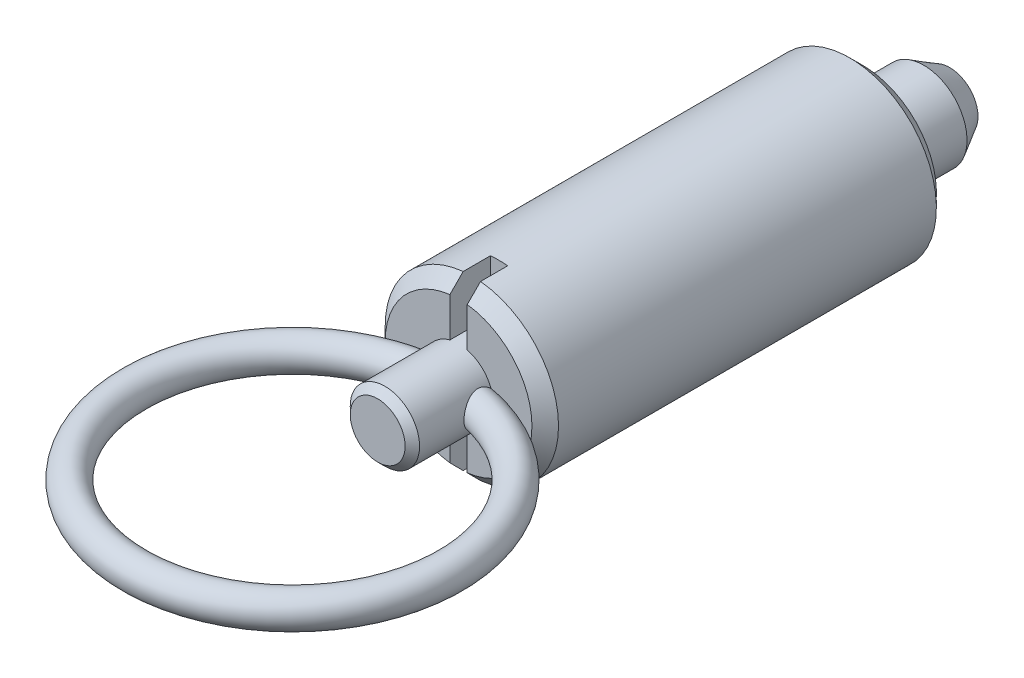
ISO-10303-21;
HEADER;
FILE_DESCRIPTION(('STEP AP214'),'2;1');
FILE_NAME('part.step','',(''),(''),'','','');
FILE_SCHEMA(('AUTOMOTIVE_DESIGN { 1 0 10303 214 1 1 1 1 }'));
ENDSEC;
DATA;
#1=APPLICATION_CONTEXT('core data for automotive mechanical design processes');
#2=APPLICATION_PROTOCOL_DEFINITION('international standard','automotive_design',2000,#1);
#3=PRODUCT_CONTEXT('',#1,'mechanical');
#4=PRODUCT('Part','Part','',(#3));
#5=PRODUCT_RELATED_PRODUCT_CATEGORY('part','',(#4));
#6=PRODUCT_DEFINITION_FORMATION('','',#4);
#7=PRODUCT_DEFINITION_CONTEXT('part definition',#1,'design');
#8=PRODUCT_DEFINITION('design','',#6,#7);
#9=PRODUCT_DEFINITION_SHAPE('','',#8);
#10=(LENGTH_UNIT() NAMED_UNIT(*) SI_UNIT(.MILLI.,.METRE.));
#11=(NAMED_UNIT(*) PLANE_ANGLE_UNIT() SI_UNIT($,.RADIAN.));
#12=(NAMED_UNIT(*) SI_UNIT($,.STERADIAN.) SOLID_ANGLE_UNIT());
#13=UNCERTAINTY_MEASURE_WITH_UNIT(LENGTH_MEASURE(1.E-05),#10,'distance_accuracy_value','');
#14=(GEOMETRIC_REPRESENTATION_CONTEXT(3) GLOBAL_UNCERTAINTY_ASSIGNED_CONTEXT((#13)) GLOBAL_UNIT_ASSIGNED_CONTEXT((#10,
#11,#12)) REPRESENTATION_CONTEXT('',''));
#15=CARTESIAN_POINT('',(0.,0.,0.));
#16=DIRECTION('',(0.,0.,1.));
#17=DIRECTION('',(1.,0.,0.));
#18=AXIS2_PLACEMENT_3D('',#15,#16,#17);
#19=CARTESIAN_POINT('',(1.96076951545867,0.,-6.));
#20=DIRECTION('',(0.,0.,1.));
#21=DIRECTION('',(0.,-1.,0.));
#22=AXIS2_PLACEMENT_3D('',#19,#20,#21);
#23=PLANE('',#22);
#24=CARTESIAN_POINT('',(0.,0.,-6.00000000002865));
#25=DIRECTION('',(0.,0.,1.));
#26=DIRECTION('',(0.,-1.,0.));
#27=AXIS2_PLACEMENT_3D('',#24,#25,#26);
#28=CIRCLE('',#27,1.9607695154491);
#29=CARTESIAN_POINT('',(0.,-1.9607695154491,-6.00000000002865));
#30=VERTEX_POINT('',#29);
#31=EDGE_CURVE('E17',#30,#30,#28,.T.);
#32=ORIENTED_EDGE('',*,*,#31,.F.);
#33=EDGE_LOOP('',(#32));
#34=FACE_BOUND('',#33,.T.);
#35=ADVANCED_FACE('F14',(#34),#23,.F.);
#36=CARTESIAN_POINT('',(0.,0.,-4.20000000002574));
#37=DIRECTION('',(0.,0.,1.));
#38=DIRECTION('',(0.,-1.,0.));
#39=AXIS2_PLACEMENT_3D('',#36,#37,#38);
#40=CONICAL_SURFACE('',#39,2.99999999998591,0.523598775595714);
#41=CARTESIAN_POINT('',(0.,0.,-4.2));
#42=DIRECTION('',(0.,0.,1.));
#43=DIRECTION('',(0.,-1.,0.));
#44=AXIS2_PLACEMENT_3D('',#41,#42,#43);
#45=CIRCLE('',#44,3.);
#46=CARTESIAN_POINT('',(0.,-3.,-4.2));
#47=VERTEX_POINT('',#46);
#48=EDGE_CURVE('E172',#47,#47,#45,.T.);
#49=ORIENTED_EDGE('',*,*,#48,.F.);
#50=EDGE_LOOP('',(#49));
#51=FACE_BOUND('',#50,.T.);
#52=ORIENTED_EDGE('',*,*,#31,.T.);
#53=EDGE_LOOP('',(#52));
#54=FACE_BOUND('',#53,.T.);
#55=ADVANCED_FACE('F307',(#51,#54),#40,.T.);
#56=CARTESIAN_POINT('',(0.,0.,-6.));
#57=DIRECTION('',(0.,0.,1.));
#58=DIRECTION('',(0.,-1.,0.));
#59=AXIS2_PLACEMENT_3D('',#56,#57,#58);
#60=CYLINDRICAL_SURFACE('',#59,3.);
#61=CARTESIAN_POINT('',(0.,0.,0.));
#62=DIRECTION('',(0.,0.,1.));
#63=DIRECTION('',(0.,-1.,0.));
#64=AXIS2_PLACEMENT_3D('',#61,#62,#63);
#65=CIRCLE('',#64,3.);
#66=CARTESIAN_POINT('',(0.,-3.,0.));
#67=VERTEX_POINT('',#66);
#68=EDGE_CURVE('E175',#67,#67,#65,.F.);
#69=ORIENTED_EDGE('',*,*,#68,.T.);
#70=EDGE_LOOP('',(#69));
#71=FACE_BOUND('',#70,.T.);
#72=ORIENTED_EDGE('',*,*,#48,.T.);
#73=EDGE_LOOP('',(#72));
#74=FACE_BOUND('',#73,.T.);
#75=ADVANCED_FACE('F304',(#71,#74),#60,.T.);
#76=CARTESIAN_POINT('',(5.08,0.,0.));
#77=DIRECTION('',(0.,0.,1.));
#78=DIRECTION('',(0.,-1.,0.));
#79=AXIS2_PLACEMENT_3D('',#76,#77,#78);
#80=PLANE('',#79);
#81=CARTESIAN_POINT('',(0.,0.,0.));
#82=DIRECTION('',(0.,0.,1.));
#83=DIRECTION('',(0.,-1.,0.));
#84=AXIS2_PLACEMENT_3D('',#81,#82,#83);
#85=CIRCLE('',#84,5.07999999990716);
#86=CARTESIAN_POINT('',(0.,-5.07999999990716,0.));
#87=VERTEX_POINT('',#86);
#88=EDGE_CURVE('E169',#87,#87,#85,.T.);
#89=ORIENTED_EDGE('',*,*,#88,.F.);
#90=EDGE_LOOP('',(#89));
#91=FACE_BOUND('',#90,.T.);
#92=ORIENTED_EDGE('',*,*,#68,.F.);
#93=EDGE_LOOP('',(#92));
#94=FACE_BOUND('',#93,.T.);
#95=ADVANCED_FACE('F300',(#91,#94),#80,.F.);
#96=CARTESIAN_POINT('',(0.,0.,0.920000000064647));
#97=DIRECTION('',(0.,0.,1.));
#98=DIRECTION('',(0.,-1.,0.));
#99=AXIS2_PLACEMENT_3D('',#96,#97,#98);
#100=CONICAL_SURFACE('',#99,5.99999999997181,0.785398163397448);
#101=CARTESIAN_POINT('',(0.,0.,0.92));
#102=DIRECTION('',(0.,0.,1.));
#103=DIRECTION('',(0.,-1.,0.));
#104=AXIS2_PLACEMENT_3D('',#101,#102,#103);
#105=CIRCLE('',#104,6.);
#106=CARTESIAN_POINT('',(0.,-6.,0.92));
#107=VERTEX_POINT('',#106);
#108=EDGE_CURVE('E109',#107,#107,#105,.T.);
#109=ORIENTED_EDGE('',*,*,#108,.F.);
#110=EDGE_LOOP('',(#109));
#111=FACE_BOUND('',#110,.T.);
#112=ORIENTED_EDGE('',*,*,#88,.T.);
#113=EDGE_LOOP('',(#112));
#114=FACE_BOUND('',#113,.T.);
#115=ADVANCED_FACE('F296',(#111,#114),#100,.T.);
#116=CARTESIAN_POINT('',(0.,0.,33.6));
#117=DIRECTION('',(0.,0.,-1.));
#118=DIRECTION('',(0.,1.,0.));
#119=AXIS2_PLACEMENT_3D('',#116,#117,#118);
#120=PLANE('',#119);
#121=CARTESIAN_POINT('',(0.,0.,33.6000000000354));
#122=DIRECTION('',(0.,0.,-1.));
#123=DIRECTION('',(0.,1.,0.));
#124=AXIS2_PLACEMENT_3D('',#121,#122,#123);
#125=CIRCLE('',#124,1.89999999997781);
#126=CARTESIAN_POINT('',(0.,1.89999999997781,33.6000000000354));
#127=VERTEX_POINT('',#126);
#128=EDGE_CURVE('E150',#127,#127,#125,.T.);
#129=ORIENTED_EDGE('',*,*,#128,.F.);
#130=EDGE_LOOP('',(#129));
#131=FACE_BOUND('',#130,.T.);
#132=ADVANCED_FACE('F284',(#131),#120,.F.);
#133=CARTESIAN_POINT('',(0.,0.,33.0999999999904));
#134=DIRECTION('',(0.,0.,-1.));
#135=DIRECTION('',(0.,1.,0.));
#136=AXIS2_PLACEMENT_3D('',#133,#134,#135);
#137=CONICAL_SURFACE('',#136,2.40000000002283,0.785398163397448);
#138=ORIENTED_EDGE('',*,*,#128,.T.);
#139=EDGE_LOOP('',(#138));
#140=FACE_BOUND('',#139,.T.);
#141=CARTESIAN_POINT('',(0.,0.,33.1));
#142=DIRECTION('',(0.,0.,1.));
#143=DIRECTION('',(0.,-1.,0.));
#144=AXIS2_PLACEMENT_3D('',#141,#142,#143);
#145=CIRCLE('',#144,2.4);
#146=CARTESIAN_POINT('',(0.,-2.4,33.1));
#147=VERTEX_POINT('',#146);
#148=EDGE_CURVE('E139',#147,#147,#145,.F.);
#149=ORIENTED_EDGE('',*,*,#148,.F.);
#150=EDGE_LOOP('',(#149));
#151=FACE_BOUND('',#150,.T.);
#152=ADVANCED_FACE('F281',(#140,#151),#137,.T.);
#153=CARTESIAN_POINT('',(0.,0.,39.5));
#154=DIRECTION('',(0.,-1.,0.));
#155=DIRECTION('',(1.,0.,0.));
#156=AXIS2_PLACEMENT_3D('',#153,#154,#155);
#157=TOROIDAL_SURFACE('',#156,10.925,1.15);
#158=CARTESIAN_POINT('',(2.25093297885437,0.83264681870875,28.0000000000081));
#159=CARTESIAN_POINT('',(2.24318235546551,0.853601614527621,28.0208983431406));
#160=CARTESIAN_POINT('',(2.2354182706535,0.873688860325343,28.042644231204));
#161=CARTESIAN_POINT('',(2.22005226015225,0.912027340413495,28.0877651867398));
#162=CARTESIAN_POINT('',(2.21245039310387,0.930277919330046,28.1111408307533));
#163=CARTESIAN_POINT('',(2.19015787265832,0.98215394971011,28.1836632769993));
#164=CARTESIAN_POINT('',(2.17600491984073,1.01283961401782,28.2351419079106));
#165=CARTESIAN_POINT('',(2.15073695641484,1.06545410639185,28.3432740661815));
#166=CARTESIAN_POINT('',(2.13963088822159,1.08735724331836,28.3999421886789));
#167=CARTESIAN_POINT('',(2.12189902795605,1.12157072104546,28.5166728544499));
#168=CARTESIAN_POINT('',(2.11526441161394,1.1338999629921,28.5767284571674));
#169=CARTESIAN_POINT('',(2.10741928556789,1.14841085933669,28.6950653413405));
#170=CARTESIAN_POINT('',(2.10593493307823,1.15110506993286,28.753267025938));
#171=CARTESIAN_POINT('',(2.10758709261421,1.14807568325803,28.8694070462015));
#172=CARTESIAN_POINT('',(2.11072755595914,1.14234488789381,28.9273451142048));
#173=CARTESIAN_POINT('',(2.12116456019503,1.12284583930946,29.0428668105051));
#174=CARTESIAN_POINT('',(2.12855851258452,1.10888900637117,29.1004089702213));
#175=CARTESIAN_POINT('',(2.14659803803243,1.0735491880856,29.212646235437));
#176=CARTESIAN_POINT('',(2.15724665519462,1.05215924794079,29.2673386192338));
#177=CARTESIAN_POINT('',(2.18257426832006,0.998687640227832,29.3814452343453));
#178=CARTESIAN_POINT('',(2.19762448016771,0.965449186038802,29.4402354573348));
#179=CARTESIAN_POINT('',(2.22900957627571,0.890597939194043,29.5519406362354));
#180=CARTESIAN_POINT('',(2.24534628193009,0.848973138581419,29.6048469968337));
#181=CARTESIAN_POINT('',(2.27964870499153,0.7524181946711,29.7094616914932));
#182=CARTESIAN_POINT('',(2.29757633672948,0.696493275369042,29.7602746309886));
#183=CARTESIAN_POINT('',(2.33079916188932,0.575568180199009,29.8507043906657));
#184=CARTESIAN_POINT('',(2.34609991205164,0.510587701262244,29.8903449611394));
#185=CARTESIAN_POINT('',(2.3681712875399,0.392763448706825,29.9462821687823));
#186=CARTESIAN_POINT('',(2.37612995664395,0.341767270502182,29.9660128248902));
#187=CARTESIAN_POINT('',(2.38885584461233,0.236947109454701,29.9972814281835));
#188=CARTESIAN_POINT('',(2.39362629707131,0.183126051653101,30.0088276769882));
#189=CARTESIAN_POINT('',(2.39948759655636,0.0738938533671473,30.0229875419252));
#190=CARTESIAN_POINT('',(2.40056413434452,0.0184773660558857,30.025566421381));
#191=CARTESIAN_POINT('',(2.39887335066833,-0.0919608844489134,30.0214968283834));
#192=CARTESIAN_POINT('',(2.39610549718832,-0.14698259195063,30.0148470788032));
#193=CARTESIAN_POINT('',(2.38730168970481,-0.251796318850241,29.9934528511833));
#194=CARTESIAN_POINT('',(2.38146308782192,-0.301707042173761,29.9791965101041));
#195=CARTESIAN_POINT('',(2.36716729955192,-0.398656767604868,29.9437052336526));
#196=CARTESIAN_POINT('',(2.35870524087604,-0.44569022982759,29.9224573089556));
#197=CARTESIAN_POINT('',(2.33890326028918,-0.540461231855,29.8715607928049));
#198=CARTESIAN_POINT('',(2.32736380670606,-0.587824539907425,29.8412972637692));
#199=CARTESIAN_POINT('',(2.30284819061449,-0.677535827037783,29.7746764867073));
#200=CARTESIAN_POINT('',(2.28987279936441,-0.719886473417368,29.738322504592));
#201=CARTESIAN_POINT('',(2.26081945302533,-0.806961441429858,29.6529300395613));
#202=CARTESIAN_POINT('',(2.24462482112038,-0.850575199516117,29.6027967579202));
#203=CARTESIAN_POINT('',(2.21295120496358,-0.929878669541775,29.4963344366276));
#204=CARTESIAN_POINT('',(2.19747318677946,-0.965557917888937,29.4399973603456));
#205=CARTESIAN_POINT('',(2.16693809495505,-1.03242467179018,29.3144430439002));
#206=CARTESIAN_POINT('',(2.15219910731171,-1.0624197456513,29.2445041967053));
#207=CARTESIAN_POINT('',(2.12805515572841,-1.11000364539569,29.0996724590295));
#208=CARTESIAN_POINT('',(2.11864109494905,-1.12761364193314,29.024788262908));
#209=CARTESIAN_POINT('',(2.10855731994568,-1.1463268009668,28.890472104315));
#210=CARTESIAN_POINT('',(2.10634937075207,-1.15034266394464,28.8315590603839));
#211=CARTESIAN_POINT('',(2.10674998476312,-1.14961251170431,28.7138369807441));
#212=CARTESIAN_POINT('',(2.10935257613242,-1.14487736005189,28.655027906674));
#213=CARTESIAN_POINT('',(2.11924768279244,-1.12645261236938,28.5391729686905));
#214=CARTESIAN_POINT('',(2.12654507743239,-1.11275369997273,28.4821290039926));
#215=CARTESIAN_POINT('',(2.14504593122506,-1.07665495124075,28.3714399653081));
#216=CARTESIAN_POINT('',(2.15625598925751,-1.0542404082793,28.3178008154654));
#217=CARTESIAN_POINT('',(2.18089440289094,-1.00224393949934,28.2170485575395));
#218=CARTESIAN_POINT('',(2.19423748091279,-0.97292255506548,28.1697786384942));
#219=CARTESIAN_POINT('',(2.22205387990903,-0.907601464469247,28.0806701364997));
#220=CARTESIAN_POINT('',(2.23652414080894,-0.871619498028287,28.0388176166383));
#221=CARTESIAN_POINT('',(2.2509329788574,-0.832646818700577,28.));
#222=B_SPLINE_CURVE_WITH_KNOTS('',3,(#158,#159,#160,#161,#162,#163,#164,#165,#166,#167,#168,
#169,#170,#171,#172,#173,#174,#175,#176,#177,#178,#179,#180,#181,#182,#183,#184,#185,#186,#187,
#188,#189,#190,#191,#192,#193,#194,#195,#196,#197,#198,#199,#200,#201,#202,#203,#204,#205,#206,
#207,#208,#209,#210,#211,#212,#213,#214,#215,#216,#217,#218,#219,#220,#221),.UNSPECIFIED.,.F.,
.F.,(4,2,2,2,2,2,2,2,2,2,2,2,2,2,2,2,2,2,2,2,2,2,2,2,2,2,2,2,2,2,2,4),(0.,0.0917288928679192,
0.183490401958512,0.367291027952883,0.551625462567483,0.735595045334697,0.909619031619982,
1.08379178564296,1.2621218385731,1.4406191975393,1.64738609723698,1.85445118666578,
2.08621136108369,2.3174750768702,2.48256458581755,2.64748640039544,2.81304636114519,
2.97862923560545,3.13467793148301,3.29101819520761,3.46252326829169,3.63393666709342,
3.83832424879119,4.04297978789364,4.27432259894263,4.50526899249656,4.68177135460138,
4.8580547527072,5.03452166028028,5.21128763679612,5.38222834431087,5.55272015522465),.UNSPECIFIED.);
#223=CARTESIAN_POINT('',(2.25093297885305,0.832646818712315,28.0000000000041));
#224=VERTEX_POINT('',#223);
#225=CARTESIAN_POINT('',(2.2509329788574,-0.832646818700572,28.));
#226=VERTEX_POINT('',#225);
#227=EDGE_CURVE('E23',#224,#226,#222,.T.);
#228=ORIENTED_EDGE('',*,*,#227,.T.);
#229=CARTESIAN_POINT('',(2.25093297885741,-0.832646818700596,28.));
#230=CARTESIAN_POINT('',(2.31244020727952,-0.821371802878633,28.));
#231=CARTESIAN_POINT('',(2.37380615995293,-0.809235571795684,28.));
#232=CARTESIAN_POINT('',(2.49699923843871,-0.782641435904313,28.));
#233=CARTESIAN_POINT('',(2.55881936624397,-0.768151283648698,28.));
#234=CARTESIAN_POINT('',(2.68218413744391,-0.736466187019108,28.));
#235=CARTESIAN_POINT('',(2.74372462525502,-0.719254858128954,28.));
#236=CARTESIAN_POINT('',(2.86866507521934,-0.680707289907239,28.));
#237=CARTESIAN_POINT('',(2.9320182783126,-0.659216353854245,28.));
#238=CARTESIAN_POINT('',(3.05672223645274,-0.611821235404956,28.));
#239=CARTESIAN_POINT('',(3.11808114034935,-0.585938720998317,28.));
#240=CARTESIAN_POINT('',(3.23781949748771,-0.528355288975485,28.));
#241=CARTESIAN_POINT('',(3.29621083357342,-0.496680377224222,28.));
#242=CARTESIAN_POINT('',(3.36715476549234,-0.45129379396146,28.));
#243=CARTESIAN_POINT('',(3.38210279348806,-0.44131269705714,28.));
#244=CARTESIAN_POINT('',(3.41153925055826,-0.420686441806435,28.));
#245=CARTESIAN_POINT('',(3.42602753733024,-0.410041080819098,28.));
#246=CARTESIAN_POINT('',(3.46865936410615,-0.377017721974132,28.));
#247=CARTESIAN_POINT('',(3.49598141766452,-0.353545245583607,28.));
#248=CARTESIAN_POINT('',(3.54769301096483,-0.302728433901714,28.));
#249=CARTESIAN_POINT('',(3.57202881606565,-0.275328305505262,28.));
#250=CARTESIAN_POINT('',(3.61517498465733,-0.216482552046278,28.));
#251=CARTESIAN_POINT('',(3.6340137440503,-0.185058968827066,28.));
#252=CARTESIAN_POINT('',(3.65709077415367,-0.132649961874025,28.));
#253=CARTESIAN_POINT('',(3.66413159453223,-0.112903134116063,28.));
#254=CARTESIAN_POINT('',(3.67487276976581,-0.0725134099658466,28.));
#255=CARTESIAN_POINT('',(3.6785760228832,-0.0518713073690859,28.));
#256=CARTESIAN_POINT('',(3.68227223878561,-0.0101626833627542,28.));
#257=CARTESIAN_POINT('',(3.68224965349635,0.0109052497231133,28.));
#258=CARTESIAN_POINT('',(3.67845747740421,0.0527030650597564,28.));
#259=CARTESIAN_POINT('',(3.67468601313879,0.0734327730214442,28.));
#260=CARTESIAN_POINT('',(3.66403458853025,0.113049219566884,28.));
#261=CARTESIAN_POINT('',(3.65730296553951,0.131976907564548,28.));
#262=CARTESIAN_POINT('',(3.64128176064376,0.168729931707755,28.));
#263=CARTESIAN_POINT('',(3.63198799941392,0.186553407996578,28.));
#264=CARTESIAN_POINT('',(3.60387247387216,0.233468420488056,28.));
#265=CARTESIAN_POINT('',(3.58303209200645,0.261345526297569,28.));
#266=CARTESIAN_POINT('',(3.53738719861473,0.313645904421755,28.));
#267=CARTESIAN_POINT('',(3.51256957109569,0.338057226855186,28.));
#268=CARTESIAN_POINT('',(3.46179038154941,0.382616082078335,28.));
#269=CARTESIAN_POINT('',(3.4359677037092,0.402924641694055,28.));
#270=CARTESIAN_POINT('',(3.38269480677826,0.441299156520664,28.));
#271=CARTESIAN_POINT('',(3.35524320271,0.45936316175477,28.));
#272=CARTESIAN_POINT('',(3.29900962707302,0.49369332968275,28.));
#273=CARTESIAN_POINT('',(3.27022031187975,0.509947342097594,28.));
#274=CARTESIAN_POINT('',(3.21179454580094,0.540805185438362,28.));
#275=CARTESIAN_POINT('',(3.1821584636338,0.555409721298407,28.));
#276=CARTESIAN_POINT('',(3.103804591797,0.591766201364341,28.));
#277=CARTESIAN_POINT('',(3.05456330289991,0.612388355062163,28.));
#278=CARTESIAN_POINT('',(2.95491310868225,0.650720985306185,28.));
#279=CARTESIAN_POINT('',(2.90450284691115,0.668427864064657,28.));
#280=CARTESIAN_POINT('',(2.8028329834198,0.701453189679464,28.));
#281=CARTESIAN_POINT('',(2.7515722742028,0.716768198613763,28.));
#282=CARTESIAN_POINT('',(2.65058410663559,0.744795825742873,28.));
#283=CARTESIAN_POINT('',(2.60087870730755,0.757588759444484,28.));
#284=CARTESIAN_POINT('',(2.50117986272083,0.781563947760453,28.));
#285=CARTESIAN_POINT('',(2.45118710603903,0.792749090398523,28.));
#286=CARTESIAN_POINT('',(2.35113965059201,0.813694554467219,28.));
#287=CARTESIAN_POINT('',(2.30108626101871,0.823461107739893,28.));
#288=CARTESIAN_POINT('',(2.2509329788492,0.832646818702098,28.));
#289=B_SPLINE_CURVE_WITH_KNOTS('',3,(#229,#230,#231,#232,#233,#234,#235,#236,#237,#238,#239,
#240,#241,#242,#243,#244,#245,#246,#247,#248,#249,#250,#251,#252,#253,#254,#255,#256,#257,#258,
#259,#260,#261,#262,#263,#264,#265,#266,#267,#268,#269,#270,#271,#272,#273,#274,#275,#276,#277,
#278,#279,#280,#281,#282,#283,#284,#285,#286,#287,#288),.UNSPECIFIED.,.F.,.F.,(4,2,2,2,2,2,2,2,
2,2,2,2,2,2,2,2,2,2,2,2,2,2,2,2,2,2,2,2,2,4),(0.,0.187615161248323,0.378059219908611,
0.569696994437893,0.770253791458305,0.969848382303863,1.16856793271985,1.22247425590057,
1.27639710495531,1.38420213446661,1.49372694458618,1.60267554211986,1.66532815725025,
1.72792631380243,1.79078570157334,1.85367651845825,1.91372233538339,1.97386668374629,
2.07767877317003,2.18184053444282,2.28024938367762,2.3787431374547,2.47786259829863,
2.5769395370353,2.73696386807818,2.89718423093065,3.05763280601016,3.21157860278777,
3.36524432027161,3.51821312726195),.UNSPECIFIED.);
#290=EDGE_CURVE('E9',#226,#224,#289,.T.);
#291=ORIENTED_EDGE('',*,*,#290,.T.);
#292=EDGE_LOOP('',(#228,#291));
#293=FACE_BOUND('',#292,.T.);
#294=CARTESIAN_POINT('',(-2.2509329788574,0.832646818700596,28.));
#295=CARTESIAN_POINT('',(-2.31244020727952,0.821371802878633,28.));
#296=CARTESIAN_POINT('',(-2.37380615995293,0.809235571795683,28.));
#297=CARTESIAN_POINT('',(-2.49699923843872,0.782641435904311,28.));
#298=CARTESIAN_POINT('',(-2.55881936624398,0.768151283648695,28.));
#299=CARTESIAN_POINT('',(-2.68218413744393,0.736466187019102,28.));
#300=CARTESIAN_POINT('',(-2.74372462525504,0.719254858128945,28.));
#301=CARTESIAN_POINT('',(-2.86866507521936,0.68070728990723,28.));
#302=CARTESIAN_POINT('',(-2.93201827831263,0.659216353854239,28.));
#303=CARTESIAN_POINT('',(-3.05672223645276,0.611821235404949,28.));
#304=CARTESIAN_POINT('',(-3.11808114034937,0.585938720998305,28.));
#305=CARTESIAN_POINT('',(-3.23781949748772,0.528355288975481,28.));
#306=CARTESIAN_POINT('',(-3.29621083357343,0.49668037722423,28.));
#307=CARTESIAN_POINT('',(-3.36715476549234,0.451293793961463,28.));
#308=CARTESIAN_POINT('',(-3.38210279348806,0.441312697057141,28.));
#309=CARTESIAN_POINT('',(-3.41153925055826,0.420686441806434,28.));
#310=CARTESIAN_POINT('',(-3.42602753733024,0.410041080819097,28.));
#311=CARTESIAN_POINT('',(-3.46865936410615,0.377017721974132,28.));
#312=CARTESIAN_POINT('',(-3.49598141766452,0.353545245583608,28.));
#313=CARTESIAN_POINT('',(-3.54769301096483,0.302728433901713,28.));
#314=CARTESIAN_POINT('',(-3.57202881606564,0.275328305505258,28.));
#315=CARTESIAN_POINT('',(-3.61517498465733,0.216482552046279,28.));
#316=CARTESIAN_POINT('',(-3.63401374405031,0.185058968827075,28.));
#317=CARTESIAN_POINT('',(-3.65709077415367,0.132649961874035,28.));
#318=CARTESIAN_POINT('',(-3.66413159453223,0.112903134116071,28.));
#319=CARTESIAN_POINT('',(-3.67487276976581,0.0725134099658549,28.));
#320=CARTESIAN_POINT('',(-3.6785760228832,0.0518713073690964,28.));
#321=CARTESIAN_POINT('',(-3.68227223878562,0.0101626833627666,28.));
#322=CARTESIAN_POINT('',(-3.68224965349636,-0.0109052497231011,28.));
#323=CARTESIAN_POINT('',(-3.67845747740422,-0.0527030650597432,28.));
#324=CARTESIAN_POINT('',(-3.6746860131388,-0.0734327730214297,28.));
#325=CARTESIAN_POINT('',(-3.66403458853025,-0.113049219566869,28.));
#326=CARTESIAN_POINT('',(-3.65730296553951,-0.131976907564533,28.));
#327=CARTESIAN_POINT('',(-3.64128176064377,-0.168729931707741,28.));
#328=CARTESIAN_POINT('',(-3.63198799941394,-0.186553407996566,28.));
#329=CARTESIAN_POINT('',(-3.60387247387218,-0.233468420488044,28.));
#330=CARTESIAN_POINT('',(-3.58303209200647,-0.261345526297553,28.));
#331=CARTESIAN_POINT('',(-3.53738719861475,-0.313645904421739,28.));
#332=CARTESIAN_POINT('',(-3.51256957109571,-0.338057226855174,28.));
#333=CARTESIAN_POINT('',(-3.46179038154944,-0.382616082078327,28.));
#334=CARTESIAN_POINT('',(-3.43596770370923,-0.402924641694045,28.));
#335=CARTESIAN_POINT('',(-3.38269480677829,-0.441299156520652,28.));
#336=CARTESIAN_POINT('',(-3.35524320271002,-0.459363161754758,28.));
#337=CARTESIAN_POINT('',(-3.29900962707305,-0.493693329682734,28.));
#338=CARTESIAN_POINT('',(-3.27022031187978,-0.509947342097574,28.));
#339=CARTESIAN_POINT('',(-3.21179454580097,-0.540805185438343,28.));
#340=CARTESIAN_POINT('',(-3.18215846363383,-0.55540972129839,28.));
#341=CARTESIAN_POINT('',(-3.10380459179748,-0.591766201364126,28.));
#342=CARTESIAN_POINT('',(-3.05456330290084,-0.612388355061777,28.));
#343=CARTESIAN_POINT('',(-2.9549131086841,-0.650720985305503,28.));
#344=CARTESIAN_POINT('',(-2.90450284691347,-0.668427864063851,28.));
#345=CARTESIAN_POINT('',(-2.80283298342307,-0.701453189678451,28.));
#346=CARTESIAN_POINT('',(-2.75157227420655,-0.716768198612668,28.));
#347=CARTESIAN_POINT('',(-2.65058410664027,-0.74479582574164,28.));
#348=CARTESIAN_POINT('',(-2.60087870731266,-0.757588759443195,28.));
#349=CARTESIAN_POINT('',(-2.50117986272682,-0.781563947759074,28.));
#350=CARTESIAN_POINT('',(-2.45118710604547,-0.792749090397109,28.));
#351=CARTESIAN_POINT('',(-2.35113965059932,-0.813694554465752,28.));
#352=CARTESIAN_POINT('',(-2.30108626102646,-0.823461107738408,28.));
#353=CARTESIAN_POINT('',(-2.25093297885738,-0.832646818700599,28.));
#354=B_SPLINE_CURVE_WITH_KNOTS('',3,(#294,#295,#296,#297,#298,#299,#300,#301,#302,#303,#304,
#305,#306,#307,#308,#309,#310,#311,#312,#313,#314,#315,#316,#317,#318,#319,#320,#321,#322,#323,
#324,#325,#326,#327,#328,#329,#330,#331,#332,#333,#334,#335,#336,#337,#338,#339,#340,#341,#342,
#343,#344,#345,#346,#347,#348,#349,#350,#351,#352,#353),.UNSPECIFIED.,.F.,.F.,(4,2,2,2,2,2,2,2,
2,2,2,2,2,2,2,2,2,2,2,2,2,2,2,2,2,2,2,2,2,4),(0.,0.187615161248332,0.378059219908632,
0.569696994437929,0.770253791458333,0.969848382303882,1.16856793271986,1.22247425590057,
1.27639710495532,1.38420213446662,1.49372694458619,1.60267554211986,1.66532815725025,
1.72792631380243,1.79078570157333,1.85367651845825,1.91372233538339,1.97386668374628,
2.07767877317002,2.18184053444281,2.28024938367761,2.37874313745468,2.47786259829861,
2.57693953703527,2.73696386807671,2.89718423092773,3.05763280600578,3.21157860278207,
3.3652443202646,3.51821312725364),.UNSPECIFIED.);
#355=CARTESIAN_POINT('',(-2.2509329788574,0.832646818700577,28.));
#356=VERTEX_POINT('',#355);
#357=CARTESIAN_POINT('',(-2.25093297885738,-0.8326468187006,28.));
#358=VERTEX_POINT('',#357);
#359=EDGE_CURVE('E206',#356,#358,#354,.T.);
#360=ORIENTED_EDGE('',*,*,#359,.T.);
#361=CARTESIAN_POINT('',(-2.25093297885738,-0.8326468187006,28.));
#362=CARTESIAN_POINT('',(-2.24318235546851,-0.85360161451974,28.0208983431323));
#363=CARTESIAN_POINT('',(-2.23541827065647,-0.873688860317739,28.0426442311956));
#364=CARTESIAN_POINT('',(-2.22005226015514,-0.912027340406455,28.087765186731));
#365=CARTESIAN_POINT('',(-2.21245039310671,-0.930277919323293,28.1111408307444));
#366=CARTESIAN_POINT('',(-2.19015787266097,-0.98215394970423,28.18366327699));
#367=CARTESIAN_POINT('',(-2.17600491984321,-1.01283961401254,28.2351419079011));
#368=CARTESIAN_POINT('',(-2.15073695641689,-1.06545410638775,28.3432740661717));
#369=CARTESIAN_POINT('',(-2.13963088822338,-1.08735724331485,28.399942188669));
#370=CARTESIAN_POINT('',(-2.12189902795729,-1.12157072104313,28.5166728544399));
#371=CARTESIAN_POINT('',(-2.11526441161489,-1.13389996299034,28.5767284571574));
#372=CARTESIAN_POINT('',(-2.10741928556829,-1.14841085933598,28.6950653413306));
#373=CARTESIAN_POINT('',(-2.10593493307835,-1.15110506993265,28.7532670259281));
#374=CARTESIAN_POINT('',(-2.10758709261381,-1.14807568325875,28.8694070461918));
#375=CARTESIAN_POINT('',(-2.11072755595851,-1.14234488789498,28.9273451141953));
#376=CARTESIAN_POINT('',(-2.12116456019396,-1.1228458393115,29.0428668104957));
#377=CARTESIAN_POINT('',(-2.12855851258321,-1.10888900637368,29.1004089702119));
#378=CARTESIAN_POINT('',(-2.1465980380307,-1.07354918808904,29.2126462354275));
#379=CARTESIAN_POINT('',(-2.15724665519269,-1.05215924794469,29.2673386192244));
#380=CARTESIAN_POINT('',(-2.18257426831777,-0.998687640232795,29.381445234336));
#381=CARTESIAN_POINT('',(-2.19762448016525,-0.96544918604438,29.4402354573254));
#382=CARTESIAN_POINT('',(-2.22900957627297,-0.890597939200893,29.5519406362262));
#383=CARTESIAN_POINT('',(-2.24534628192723,-0.848973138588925,29.6048469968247));
#384=CARTESIAN_POINT('',(-2.27964870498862,-0.752418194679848,29.7094616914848));
#385=CARTESIAN_POINT('',(-2.29757633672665,-0.696493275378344,29.7602746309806));
#386=CARTESIAN_POINT('',(-2.33079916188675,-0.575568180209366,29.8507043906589));
#387=CARTESIAN_POINT('',(-2.34609991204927,-0.510587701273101,29.8903449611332));
#388=CARTESIAN_POINT('',(-2.368171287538,-0.392763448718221,29.9462821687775));
#389=CARTESIAN_POINT('',(-2.37612995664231,-0.341767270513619,29.9660128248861));
#390=CARTESIAN_POINT('',(-2.3888558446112,-0.236947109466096,29.9972814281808));
#391=CARTESIAN_POINT('',(-2.39362629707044,-0.183126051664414,30.0088276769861));
#392=CARTESIAN_POINT('',(-2.39948759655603,-0.0738938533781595,30.0229875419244));
#393=CARTESIAN_POINT('',(-2.40056413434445,-0.0184773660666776,30.0255664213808));
#394=CARTESIAN_POINT('',(-2.39887335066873,0.0919608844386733,30.0214968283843));
#395=CARTESIAN_POINT('',(-2.39610549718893,0.146982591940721,30.0148470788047));
#396=CARTESIAN_POINT('',(-2.3873016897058,0.251796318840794,29.9934528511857));
#397=CARTESIAN_POINT('',(-2.3814630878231,0.301707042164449,29.979196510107));
#398=CARTESIAN_POINT('',(-2.36716729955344,0.398656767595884,29.9437052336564));
#399=CARTESIAN_POINT('',(-2.35870524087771,0.445690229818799,29.9224573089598));
#400=CARTESIAN_POINT('',(-2.33890326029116,0.540461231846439,29.87156079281));
#401=CARTESIAN_POINT('',(-2.32736380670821,0.587824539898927,29.8412972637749));
#402=CARTESIAN_POINT('',(-2.30284819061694,0.677535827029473,29.7746764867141));
#403=CARTESIAN_POINT('',(-2.28987279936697,0.719886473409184,29.7383225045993));
#404=CARTESIAN_POINT('',(-2.26081945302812,0.806961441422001,29.6529300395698));
#405=CARTESIAN_POINT('',(-2.24462482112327,0.850575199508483,29.6027967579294));
#406=CARTESIAN_POINT('',(-2.21295120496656,0.929878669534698,29.4963344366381));
#407=CARTESIAN_POINT('',(-2.19747318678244,0.965557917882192,29.4399973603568));
#408=CARTESIAN_POINT('',(-2.1669380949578,1.03242467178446,29.3144430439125));
#409=CARTESIAN_POINT('',(-2.15219910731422,1.06241974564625,29.2445041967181));
#410=CARTESIAN_POINT('',(-2.12805515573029,1.11000364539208,29.099672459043));
#411=CARTESIAN_POINT('',(-2.11864109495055,1.12761364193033,29.0247882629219));
#412=CARTESIAN_POINT('',(-2.10855731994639,1.14632680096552,28.890472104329));
#413=CARTESIAN_POINT('',(-2.1063493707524,1.15034266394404,28.8315590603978));
#414=CARTESIAN_POINT('',(-2.1067499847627,1.14961251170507,28.7138369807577));
#415=CARTESIAN_POINT('',(-2.10935257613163,1.14487736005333,28.6550279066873));
#416=CARTESIAN_POINT('',(-2.11924768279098,1.1264526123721,28.5391729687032));
#417=CARTESIAN_POINT('',(-2.12654507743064,1.11275369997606,28.482129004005));
#418=CARTESIAN_POINT('',(-2.14504593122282,1.07665495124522,28.3714399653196));
#419=CARTESIAN_POINT('',(-2.15625598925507,1.05424040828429,28.3178008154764));
#420=CARTESIAN_POINT('',(-2.18089440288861,1.00224393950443,28.217048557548));
#421=CARTESIAN_POINT('',(-2.19423748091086,0.972922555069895,28.1697786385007));
#422=CARTESIAN_POINT('',(-2.22205387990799,0.90760146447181,28.0806701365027));
#423=CARTESIAN_POINT('',(-2.23652414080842,0.871619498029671,28.0388176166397));
#424=CARTESIAN_POINT('',(-2.25093297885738,0.832646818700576,28.));
#425=B_SPLINE_CURVE_WITH_KNOTS('',3,(#361,#362,#363,#364,#365,#366,#367,#368,#369,#370,#371,
#372,#373,#374,#375,#376,#377,#378,#379,#380,#381,#382,#383,#384,#385,#386,#387,#388,#389,#390,
#391,#392,#393,#394,#395,#396,#397,#398,#399,#400,#401,#402,#403,#404,#405,#406,#407,#408,#409,
#410,#411,#412,#413,#414,#415,#416,#417,#418,#419,#420,#421,#422,#423,#424),.UNSPECIFIED.,.F.,
.F.,(4,2,2,2,2,2,2,2,2,2,2,2,2,2,2,2,2,2,2,2,2,2,2,2,2,2,2,2,2,2,2,4),(0.,0.0917288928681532,
0.183490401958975,0.36729102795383,0.551625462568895,0.735595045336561,0.90961903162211,
1.08379178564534,1.26212183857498,1.44061919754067,1.64738609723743,1.85445118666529,
2.08621136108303,2.31747507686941,2.48256458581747,2.64748640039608,2.81304636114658,
2.97862923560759,3.13467793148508,3.29101819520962,3.46252326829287,3.63393666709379,
3.83832424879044,4.04297978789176,4.2743225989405,4.5052689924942,4.68177135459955,
4.85805475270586,5.03452166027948,5.21128763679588,5.38222834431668,5.55272015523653),.UNSPECIFIED.);
#426=EDGE_CURVE('E213',#358,#356,#425,.T.);
#427=ORIENTED_EDGE('',*,*,#426,.T.);
#428=EDGE_LOOP('',(#360,#427));
#429=FACE_BOUND('',#428,.T.);
#430=ADVANCED_FACE('F190',(#293,#429),#157,.T.);
#431=CARTESIAN_POINT('',(0.,0.,28.));
#432=DIRECTION('',(0.,0.,-1.));
#433=DIRECTION('',(0.,1.,0.));
#434=AXIS2_PLACEMENT_3D('',#431,#432,#433);
#435=PLANE('',#434);
#436=ORIENTED_EDGE('',*,*,#290,.F.);
#437=CARTESIAN_POINT('',(0.,0.,28.));
#438=DIRECTION('',(0.,0.,1.));
#439=DIRECTION('',(0.,-1.,0.));
#440=AXIS2_PLACEMENT_3D('',#437,#438,#439);
#441=CIRCLE('',#440,2.4);
#442=CARTESIAN_POINT('',(0.6,-2.32379000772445,28.));
#443=VERTEX_POINT('',#442);
#444=EDGE_CURVE('E32',#443,#226,#441,.T.);
#445=ORIENTED_EDGE('',*,*,#444,.F.);
#446=DIRECTION('',(0.,1.,0.));
#447=VECTOR('',#446,1.);
#448=CARTESIAN_POINT('',(0.6,0.,28.));
#449=LINE('',#448,#447);
#450=CARTESIAN_POINT('',(0.6,-5.04444248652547,28.0000000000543));
#451=VERTEX_POINT('',#450);
#452=EDGE_CURVE('E220',#451,#443,#449,.T.);
#453=ORIENTED_EDGE('',*,*,#452,.F.);
#454=CARTESIAN_POINT('',(0.,0.,28.0000000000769));
#455=DIRECTION('',(0.,0.,-1.));
#456=DIRECTION('',(0.,1.,0.));
#457=AXIS2_PLACEMENT_3D('',#454,#455,#456);
#458=CIRCLE('',#457,5.079999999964);
#459=CARTESIAN_POINT('',(0.6,5.04444248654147,28.0000000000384));
#460=VERTEX_POINT('',#459);
#461=EDGE_CURVE('E221',#460,#451,#458,.T.);
#462=ORIENTED_EDGE('',*,*,#461,.F.);
#463=DIRECTION('',(0.,1.,0.));
#464=VECTOR('',#463,1.);
#465=CARTESIAN_POINT('',(0.6,0.,28.));
#466=LINE('',#465,#464);
#467=CARTESIAN_POINT('',(0.6,2.32379000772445,28.));
#468=VERTEX_POINT('',#467);
#469=EDGE_CURVE('E223',#468,#460,#466,.T.);
#470=ORIENTED_EDGE('',*,*,#469,.F.);
#471=CARTESIAN_POINT('',(0.,0.,28.));
#472=DIRECTION('',(0.,0.,1.));
#473=DIRECTION('',(0.,-1.,0.));
#474=AXIS2_PLACEMENT_3D('',#471,#472,#473);
#475=CIRCLE('',#474,2.4);
#476=EDGE_CURVE('E123',#224,#468,#475,.T.);
#477=ORIENTED_EDGE('',*,*,#476,.F.);
#478=EDGE_LOOP('',(#436,#445,#453,#462,#470,#477));
#479=FACE_BOUND('',#478,.T.);
#480=ADVANCED_FACE('F193',(#479),#435,.F.);
#481=CARTESIAN_POINT('',(0.,0.,22.4));
#482=DIRECTION('',(0.,0.,1.));
#483=DIRECTION('',(0.,-1.,0.));
#484=AXIS2_PLACEMENT_3D('',#481,#482,#483);
#485=CYLINDRICAL_SURFACE('',#484,2.4);
#486=ORIENTED_EDGE('',*,*,#148,.T.);
#487=EDGE_LOOP('',(#486));
#488=FACE_BOUND('',#487,.T.);
#489=CARTESIAN_POINT('',(0.,0.,25.2));
#490=DIRECTION('',(0.,0.,1.));
#491=DIRECTION('',(0.,-1.,0.));
#492=AXIS2_PLACEMENT_3D('',#489,#490,#491);
#493=CIRCLE('',#492,2.4);
#494=CARTESIAN_POINT('',(0.6,-2.32379000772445,25.2));
#495=VERTEX_POINT('',#494);
#496=CARTESIAN_POINT('',(-0.6,-2.32379000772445,25.2));
#497=VERTEX_POINT('',#496);
#498=EDGE_CURVE('E108',#495,#497,#493,.F.);
#499=ORIENTED_EDGE('',*,*,#498,.F.);
#500=DIRECTION('',(0.,0.,1.));
#501=VECTOR('',#500,1.);
#502=CARTESIAN_POINT('',(0.6,-2.32379000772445,22.4));
#503=LINE('',#502,#501);
#504=EDGE_CURVE('E137',#495,#443,#503,.T.);
#505=ORIENTED_EDGE('',*,*,#504,.T.);
#506=ORIENTED_EDGE('',*,*,#444,.T.);
#507=ORIENTED_EDGE('',*,*,#227,.F.);
#508=ORIENTED_EDGE('',*,*,#476,.T.);
#509=DIRECTION('',(0.,0.,1.));
#510=VECTOR('',#509,1.);
#511=CARTESIAN_POINT('',(0.6,2.32379000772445,22.4));
#512=LINE('',#511,#510);
#513=CARTESIAN_POINT('',(0.6,2.32379000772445,25.2));
#514=VERTEX_POINT('',#513);
#515=EDGE_CURVE('E116',#468,#514,#512,.F.);
#516=ORIENTED_EDGE('',*,*,#515,.T.);
#517=CARTESIAN_POINT('',(0.,0.,25.2));
#518=DIRECTION('',(0.,0.,1.));
#519=DIRECTION('',(0.,-1.,0.));
#520=AXIS2_PLACEMENT_3D('',#517,#518,#519);
#521=CIRCLE('',#520,2.4);
#522=CARTESIAN_POINT('',(-0.6,2.32379000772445,25.2));
#523=VERTEX_POINT('',#522);
#524=EDGE_CURVE('E98',#523,#514,#521,.F.);
#525=ORIENTED_EDGE('',*,*,#524,.F.);
#526=DIRECTION('',(0.,0.,1.));
#527=VECTOR('',#526,1.);
#528=CARTESIAN_POINT('',(-0.6,2.32379000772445,22.4));
#529=LINE('',#528,#527);
#530=CARTESIAN_POINT('',(-0.6,2.32379000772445,28.));
#531=VERTEX_POINT('',#530);
#532=EDGE_CURVE('E125',#523,#531,#529,.T.);
#533=ORIENTED_EDGE('',*,*,#532,.T.);
#534=CARTESIAN_POINT('',(0.,0.,28.));
#535=DIRECTION('',(0.,0.,1.));
#536=DIRECTION('',(0.,-1.,0.));
#537=AXIS2_PLACEMENT_3D('',#534,#535,#536);
#538=CIRCLE('',#537,2.4);
#539=EDGE_CURVE('E227',#531,#356,#538,.T.);
#540=ORIENTED_EDGE('',*,*,#539,.T.);
#541=ORIENTED_EDGE('',*,*,#426,.F.);
#542=CARTESIAN_POINT('',(0.,0.,28.));
#543=DIRECTION('',(0.,0.,1.));
#544=DIRECTION('',(0.,-1.,0.));
#545=AXIS2_PLACEMENT_3D('',#542,#543,#544);
#546=CIRCLE('',#545,2.4);
#547=CARTESIAN_POINT('',(-0.6,-2.32379000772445,28.));
#548=VERTEX_POINT('',#547);
#549=EDGE_CURVE('E224',#358,#548,#546,.T.);
#550=ORIENTED_EDGE('',*,*,#549,.T.);
#551=DIRECTION('',(0.,0.,1.));
#552=VECTOR('',#551,1.);
#553=CARTESIAN_POINT('',(-0.6,-2.32379000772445,22.4));
#554=LINE('',#553,#552);
#555=EDGE_CURVE('E128',#548,#497,#554,.F.);
#556=ORIENTED_EDGE('',*,*,#555,.T.);
#557=EDGE_LOOP('',(#499,#505,#506,#507,#508,#516,#525,#533,#540,#541,#550,#556));
#558=FACE_BOUND('',#557,.T.);
#559=ADVANCED_FACE('F121',(#488,#558),#485,.T.);
#560=CARTESIAN_POINT('',(0.,0.,28.));
#561=DIRECTION('',(0.,0.,-1.));
#562=DIRECTION('',(0.,1.,0.));
#563=AXIS2_PLACEMENT_3D('',#560,#561,#562);
#564=PLANE('',#563);
#565=ORIENTED_EDGE('',*,*,#359,.F.);
#566=ORIENTED_EDGE('',*,*,#539,.F.);
#567=DIRECTION('',(0.,1.,0.));
#568=VECTOR('',#567,1.);
#569=CARTESIAN_POINT('',(-0.6,0.,28.));
#570=LINE('',#569,#568);
#571=CARTESIAN_POINT('',(-0.6,5.04444248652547,28.0000000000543));
#572=VERTEX_POINT('',#571);
#573=EDGE_CURVE('E229',#572,#531,#570,.F.);
#574=ORIENTED_EDGE('',*,*,#573,.F.);
#575=CARTESIAN_POINT('',(0.,0.,28.0000000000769));
#576=DIRECTION('',(0.,0.,-1.));
#577=DIRECTION('',(0.,1.,0.));
#578=AXIS2_PLACEMENT_3D('',#575,#576,#577);
#579=CIRCLE('',#578,5.079999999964);
#580=CARTESIAN_POINT('',(-0.6,-5.04444248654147,28.0000000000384));
#581=VERTEX_POINT('',#580);
#582=EDGE_CURVE('E230',#581,#572,#579,.T.);
#583=ORIENTED_EDGE('',*,*,#582,.F.);
#584=DIRECTION('',(0.,1.,0.));
#585=VECTOR('',#584,1.);
#586=CARTESIAN_POINT('',(-0.6,0.,28.));
#587=LINE('',#586,#585);
#588=EDGE_CURVE('E231',#548,#581,#587,.F.);
#589=ORIENTED_EDGE('',*,*,#588,.F.);
#590=ORIENTED_EDGE('',*,*,#549,.F.);
#591=EDGE_LOOP('',(#565,#566,#574,#583,#589,#590));
#592=FACE_BOUND('',#591,.T.);
#593=ADVANCED_FACE('F198',(#592),#564,.F.);
#594=CARTESIAN_POINT('',(0.,0.,27.0799999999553));
#595=DIRECTION('',(0.,0.,-1.));
#596=DIRECTION('',(0.,1.,0.));
#597=AXIS2_PLACEMENT_3D('',#594,#595,#596);
#598=CONICAL_SURFACE('',#597,6.00000000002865,0.785398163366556);
#599=CARTESIAN_POINT('',(-0.6,-5.969924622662,27.0799999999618));
#600=CARTESIAN_POINT('',(-0.6,-5.81575369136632,27.2334098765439));
#601=CARTESIAN_POINT('',(-0.6,-5.66154471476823,27.3867814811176));
#602=CARTESIAN_POINT('',(-0.6,-5.35305066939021,27.6934481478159));
#603=CARTESIAN_POINT('',(-0.6,-5.1987656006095,27.8467432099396));
#604=CARTESIAN_POINT('',(-0.6,-5.0444424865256,28.0000000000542));
#605=B_SPLINE_CURVE_WITH_KNOTS('',3,(#599,#600,#601,#602,#603,#604),.UNSPECIFIED.,.F.,.F.,(4,2,
4),(0.,0.652479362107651,1.30495873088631),.UNSPECIFIED.);
#606=CARTESIAN_POINT('',(-0.6,-5.96992462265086,27.0799999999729));
#607=VERTEX_POINT('',#606);
#608=EDGE_CURVE('E152',#607,#581,#605,.T.);
#609=ORIENTED_EDGE('',*,*,#608,.T.);
#610=ORIENTED_EDGE('',*,*,#582,.T.);
#611=CARTESIAN_POINT('',(-0.6,5.96992462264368,27.0799999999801));
#612=CARTESIAN_POINT('',(-0.6,5.8157536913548,27.2334098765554));
#613=CARTESIAN_POINT('',(-0.6,5.66154471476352,27.3867814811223));
#614=CARTESIAN_POINT('',(-0.6,5.35305066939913,27.693448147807));
#615=CARTESIAN_POINT('',(-0.6,5.19876560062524,27.846743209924));
#616=CARTESIAN_POINT('',(-0.6,5.04444248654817,28.0000000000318));
#617=B_SPLINE_CURVE_WITH_KNOTS('',3,(#611,#612,#613,#614,#615,#616),.UNSPECIFIED.,.F.,.F.,(4,2,
4),(0.,0.652479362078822,1.30495873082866),.UNSPECIFIED.);
#618=CARTESIAN_POINT('',(-0.6,5.9699246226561,27.0799999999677));
#619=VERTEX_POINT('',#618);
#620=EDGE_CURVE('E119',#619,#572,#617,.T.);
#621=ORIENTED_EDGE('',*,*,#620,.F.);
#622=CARTESIAN_POINT('',(0.,0.,27.0799999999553));
#623=DIRECTION('',(0.,0.,-1.));
#624=DIRECTION('',(0.,1.,0.));
#625=AXIS2_PLACEMENT_3D('',#622,#623,#624);
#626=CIRCLE('',#625,6.00000000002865);
#627=EDGE_CURVE('E160',#619,#607,#626,.F.);
#628=ORIENTED_EDGE('',*,*,#627,.T.);
#629=EDGE_LOOP('',(#609,#610,#621,#628));
#630=FACE_BOUND('',#629,.T.);
#631=ADVANCED_FACE('F201',(#630),#598,.T.);
#632=CARTESIAN_POINT('',(-0.6,-12.,28.001));
#633=DIRECTION('',(1.,0.,0.));
#634=DIRECTION('',(0.,1.,0.));
#635=AXIS2_PLACEMENT_3D('',#632,#633,#634);
#636=PLANE('',#635);
#637=ORIENTED_EDGE('',*,*,#608,.F.);
#638=DIRECTION('',(0.,0.,1.));
#639=VECTOR('',#638,1.);
#640=CARTESIAN_POINT('',(-0.6,-5.96992462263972,28.001));
#641=LINE('',#640,#639);
#642=CARTESIAN_POINT('',(-0.6,-5.96992462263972,25.2));
#643=VERTEX_POINT('',#642);
#644=EDGE_CURVE('E149',#607,#643,#641,.F.);
#645=ORIENTED_EDGE('',*,*,#644,.T.);
#646=DIRECTION('',(0.,1.,0.));
#647=VECTOR('',#646,1.);
#648=CARTESIAN_POINT('',(-0.6,-12.,25.2));
#649=LINE('',#648,#647);
#650=EDGE_CURVE('E146',#643,#497,#649,.T.);
#651=ORIENTED_EDGE('',*,*,#650,.T.);
#652=ORIENTED_EDGE('',*,*,#555,.F.);
#653=ORIENTED_EDGE('',*,*,#588,.T.);
#654=EDGE_LOOP('',(#637,#645,#651,#652,#653));
#655=FACE_BOUND('',#654,.T.);
#656=ADVANCED_FACE('F275',(#655),#636,.T.);
#657=CARTESIAN_POINT('',(-0.6,-12.,25.2));
#658=DIRECTION('',(0.,0.,1.));
#659=DIRECTION('',(0.,-1.,0.));
#660=AXIS2_PLACEMENT_3D('',#657,#658,#659);
#661=PLANE('',#660);
#662=ORIENTED_EDGE('',*,*,#650,.F.);
#663=CARTESIAN_POINT('',(0.,0.,25.2));
#664=DIRECTION('',(0.,0.,1.));
#665=DIRECTION('',(0.,-1.,0.));
#666=AXIS2_PLACEMENT_3D('',#663,#664,#665);
#667=CIRCLE('',#666,6.);
#668=CARTESIAN_POINT('',(0.6,-5.96992462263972,25.2));
#669=VERTEX_POINT('',#668);
#670=EDGE_CURVE('E463',#669,#643,#667,.F.);
#671=ORIENTED_EDGE('',*,*,#670,.F.);
#672=DIRECTION('',(0.,-1.,0.));
#673=VECTOR('',#672,1.);
#674=CARTESIAN_POINT('',(0.6,-12.,25.2));
#675=LINE('',#674,#673);
#676=EDGE_CURVE('E142',#495,#669,#675,.T.);
#677=ORIENTED_EDGE('',*,*,#676,.F.);
#678=ORIENTED_EDGE('',*,*,#498,.T.);
#679=EDGE_LOOP('',(#662,#671,#677,#678));
#680=FACE_BOUND('',#679,.T.);
#681=ADVANCED_FACE('F279',(#680),#661,.T.);
#682=CARTESIAN_POINT('',(0.6,-12.,25.2));
#683=DIRECTION('',(-1.,0.,0.));
#684=DIRECTION('',(0.,-1.,0.));
#685=AXIS2_PLACEMENT_3D('',#682,#683,#684);
#686=PLANE('',#685);
#687=DIRECTION('',(0.,0.,1.));
#688=VECTOR('',#687,1.);
#689=CARTESIAN_POINT('',(0.6,-5.96992462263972,25.2));
#690=LINE('',#689,#688);
#691=CARTESIAN_POINT('',(0.6,-5.9699246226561,27.0799999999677));
#692=VERTEX_POINT('',#691);
#693=EDGE_CURVE('E131',#669,#692,#690,.T.);
#694=ORIENTED_EDGE('',*,*,#693,.T.);
#695=CARTESIAN_POINT('',(0.6,-5.96992462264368,27.0799999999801));
#696=CARTESIAN_POINT('',(0.6,-5.8157536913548,27.2334098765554));
#697=CARTESIAN_POINT('',(0.6,-5.66154471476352,27.3867814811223));
#698=CARTESIAN_POINT('',(0.6,-5.35305066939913,27.693448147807));
#699=CARTESIAN_POINT('',(0.6,-5.19876560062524,27.846743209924));
#700=CARTESIAN_POINT('',(0.6,-5.04444248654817,28.0000000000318));
#701=B_SPLINE_CURVE_WITH_KNOTS('',3,(#695,#696,#697,#698,#699,#700),.UNSPECIFIED.,.F.,.F.,(4,2,
4),(0.,0.652479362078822,1.30495873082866),.UNSPECIFIED.);
#702=EDGE_CURVE('E126',#692,#451,#701,.T.);
#703=ORIENTED_EDGE('',*,*,#702,.T.);
#704=ORIENTED_EDGE('',*,*,#452,.T.);
#705=ORIENTED_EDGE('',*,*,#504,.F.);
#706=ORIENTED_EDGE('',*,*,#676,.T.);
#707=EDGE_LOOP('',(#694,#703,#704,#705,#706));
#708=FACE_BOUND('',#707,.T.);
#709=ADVANCED_FACE('F244',(#708),#686,.T.);
#710=CARTESIAN_POINT('',(0.,0.,27.0799999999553));
#711=DIRECTION('',(0.,0.,-1.));
#712=DIRECTION('',(0.,1.,0.));
#713=AXIS2_PLACEMENT_3D('',#710,#711,#712);
#714=CONICAL_SURFACE('',#713,6.00000000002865,0.785398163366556);
#715=ORIENTED_EDGE('',*,*,#702,.F.);
#716=CARTESIAN_POINT('',(0.,0.,27.0799999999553));
#717=DIRECTION('',(0.,0.,-1.));
#718=DIRECTION('',(0.,1.,0.));
#719=AXIS2_PLACEMENT_3D('',#716,#717,#718);
#720=CIRCLE('',#719,6.00000000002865);
#721=CARTESIAN_POINT('',(0.6,5.96992462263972,27.0799999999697));
#722=VERTEX_POINT('',#721);
#723=EDGE_CURVE('E145',#692,#722,#720,.F.);
#724=ORIENTED_EDGE('',*,*,#723,.T.);
#725=CARTESIAN_POINT('',(0.6,5.96992462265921,27.0799999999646));
#726=CARTESIAN_POINT('',(0.6,5.815753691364,27.2334098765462));
#727=CARTESIAN_POINT('',(0.6,5.66154471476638,27.3867814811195));
#728=CARTESIAN_POINT('',(0.6,5.35305066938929,27.6934481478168));
#729=CARTESIAN_POINT('',(0.6,5.19876560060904,27.8467432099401));
#730=CARTESIAN_POINT('',(0.6,5.0444424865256,28.0000000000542));
#731=B_SPLINE_CURVE_WITH_KNOTS('',3,(#725,#726,#727,#728,#729,#730),.UNSPECIFIED.,.F.,.F.,(4,2,
4),(0.,0.652479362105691,1.3049587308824),.UNSPECIFIED.);
#732=EDGE_CURVE('E156',#722,#460,#731,.T.);
#733=ORIENTED_EDGE('',*,*,#732,.T.);
#734=ORIENTED_EDGE('',*,*,#461,.T.);
#735=EDGE_LOOP('',(#715,#724,#733,#734));
#736=FACE_BOUND('',#735,.T.);
#737=ADVANCED_FACE('F246',(#736),#714,.T.);
#738=CARTESIAN_POINT('',(0.6,-12.,25.2));
#739=DIRECTION('',(-1.,0.,0.));
#740=DIRECTION('',(0.,-1.,0.));
#741=AXIS2_PLACEMENT_3D('',#738,#739,#740);
#742=PLANE('',#741);
#743=ORIENTED_EDGE('',*,*,#732,.F.);
#744=DIRECTION('',(0.,0.,1.));
#745=VECTOR('',#744,1.);
#746=CARTESIAN_POINT('',(0.6,5.96992462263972,25.2));
#747=LINE('',#746,#745);
#748=CARTESIAN_POINT('',(0.6,5.96992462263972,25.2));
#749=VERTEX_POINT('',#748);
#750=EDGE_CURVE('E118',#722,#749,#747,.F.);
#751=ORIENTED_EDGE('',*,*,#750,.T.);
#752=DIRECTION('',(0.,-1.,0.));
#753=VECTOR('',#752,1.);
#754=CARTESIAN_POINT('',(0.6,-12.,25.2));
#755=LINE('',#754,#753);
#756=EDGE_CURVE('E103',#749,#514,#755,.T.);
#757=ORIENTED_EDGE('',*,*,#756,.T.);
#758=ORIENTED_EDGE('',*,*,#515,.F.);
#759=ORIENTED_EDGE('',*,*,#469,.T.);
#760=EDGE_LOOP('',(#743,#751,#757,#758,#759));
#761=FACE_BOUND('',#760,.T.);
#762=ADVANCED_FACE('F115',(#761),#742,.T.);
#763=CARTESIAN_POINT('',(-0.6,-12.,25.2));
#764=DIRECTION('',(0.,0.,1.));
#765=DIRECTION('',(0.,-1.,0.));
#766=AXIS2_PLACEMENT_3D('',#763,#764,#765);
#767=PLANE('',#766);
#768=ORIENTED_EDGE('',*,*,#756,.F.);
#769=CARTESIAN_POINT('',(0.,0.,25.2));
#770=DIRECTION('',(0.,0.,1.));
#771=DIRECTION('',(0.,-1.,0.));
#772=AXIS2_PLACEMENT_3D('',#769,#770,#771);
#773=CIRCLE('',#772,6.);
#774=CARTESIAN_POINT('',(-0.6,5.96992462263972,25.2));
#775=VERTEX_POINT('',#774);
#776=EDGE_CURVE('E486',#775,#749,#773,.F.);
#777=ORIENTED_EDGE('',*,*,#776,.F.);
#778=DIRECTION('',(0.,1.,0.));
#779=VECTOR('',#778,1.);
#780=CARTESIAN_POINT('',(-0.6,-12.,25.2));
#781=LINE('',#780,#779);
#782=EDGE_CURVE('E106',#523,#775,#781,.T.);
#783=ORIENTED_EDGE('',*,*,#782,.F.);
#784=ORIENTED_EDGE('',*,*,#524,.T.);
#785=EDGE_LOOP('',(#768,#777,#783,#784));
#786=FACE_BOUND('',#785,.T.);
#787=ADVANCED_FACE('F102',(#786),#767,.T.);
#788=CARTESIAN_POINT('',(-0.6,-12.,28.001));
#789=DIRECTION('',(1.,0.,0.));
#790=DIRECTION('',(0.,1.,0.));
#791=AXIS2_PLACEMENT_3D('',#788,#789,#790);
#792=PLANE('',#791);
#793=DIRECTION('',(0.,0.,1.));
#794=VECTOR('',#793,1.);
#795=CARTESIAN_POINT('',(-0.6,5.96992462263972,28.001));
#796=LINE('',#795,#794);
#797=EDGE_CURVE('E151',#775,#619,#796,.T.);
#798=ORIENTED_EDGE('',*,*,#797,.T.);
#799=ORIENTED_EDGE('',*,*,#620,.T.);
#800=ORIENTED_EDGE('',*,*,#573,.T.);
#801=ORIENTED_EDGE('',*,*,#532,.F.);
#802=ORIENTED_EDGE('',*,*,#782,.T.);
#803=EDGE_LOOP('',(#798,#799,#800,#801,#802));
#804=FACE_BOUND('',#803,.T.);
#805=ADVANCED_FACE('F254',(#804),#792,.T.);
#806=CARTESIAN_POINT('',(0.,0.,-6.));
#807=DIRECTION('',(0.,0.,1.));
#808=DIRECTION('',(0.,-1.,0.));
#809=AXIS2_PLACEMENT_3D('',#806,#807,#808);
#810=CYLINDRICAL_SURFACE('',#809,6.);
#811=ORIENTED_EDGE('',*,*,#797,.F.);
#812=ORIENTED_EDGE('',*,*,#776,.T.);
#813=ORIENTED_EDGE('',*,*,#750,.F.);
#814=ORIENTED_EDGE('',*,*,#723,.F.);
#815=ORIENTED_EDGE('',*,*,#693,.F.);
#816=ORIENTED_EDGE('',*,*,#670,.T.);
#817=ORIENTED_EDGE('',*,*,#644,.F.);
#818=ORIENTED_EDGE('',*,*,#627,.F.);
#819=EDGE_LOOP('',(#811,#812,#813,#814,#815,#816,#817,#818));
#820=FACE_BOUND('',#819,.T.);
#821=ORIENTED_EDGE('',*,*,#108,.T.);
#822=EDGE_LOOP('',(#821));
#823=FACE_BOUND('',#822,.T.);
#824=ADVANCED_FACE('F258',(#820,#823),#810,.T.);
#825=CLOSED_SHELL('',(#35,#55,#75,#95,#115,#132,#152,#430,#480,#559,#593,#631,#656,#681,#709,
#737,#762,#787,#805,#824));
#826=MANIFOLD_SOLID_BREP('B1',#825);
#827=ADVANCED_BREP_SHAPE_REPRESENTATION('',(#18,#826),#14);
#828=SHAPE_DEFINITION_REPRESENTATION(#9,#827);
ENDSEC;
END-ISO-10303-21;
